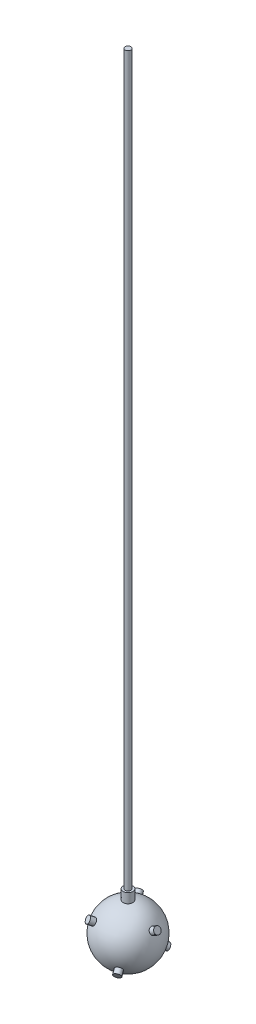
from build123d import *

# Parameters (mm, degrees)
CROQUIS2_W              = 10
CROQUIS2_H              = 20
CROQUIS164_R            = 6
SALIENTE_EXTRUIR1_DEPTH = 1500
BARRER1_PROFILE_R       = 7
MATRIZC2_COUNT          = 3


with BuildPart() as part:
    # Croquis1 → Revoluci_n1 (revolve)
    with BuildSketch(Plane.XY):
        with BuildLine():
            Line((0, -60), (0, 60))
            ThreePointArc((0, 60), (60, 0), (0, -60))
        make_face()
    revolve(axis=Axis((0, -60, 0), (0, 1, 0)))

    # Croquis2 → Revoluci_n2 (revolve)
    with BuildSketch(Plane.XY, mode=Mode.PRIVATE) as revoluci_n2_sk:
        with Locations((5, 69.160797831)):
            Rectangle(CROQUIS2_W, CROQUIS2_H)
    revolve(revoluci_n2_sk.sketch.rotate(Axis((0, 0, 0), (0, 1, 0)), 180), axis=Axis((0, 0, 0), (0, 1, 0)))

    # Croquis164 → Saliente-Extruir1 (add)
    with BuildSketch(Plane(origin=(0, 79.160797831, 0), x_dir=(1, 0, 0), z_dir=(0, 1, 0))):
        with Locations(Location((0, 0, 0), (0, 0, 270))):
            Circle(CROQUIS164_R)
    extrude(amount=SALIENTE_EXTRUIR1_DEPTH)


with BuildPart() as body_2:
    # Barrer1: sweep along a path in Croquis152
    with BuildLine(Plane.XY) as barrer1_path:
        Line((60.621778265, 35), (0, 0))
        Line((0, 0), (-60.621778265, -35))
    # Barrer1 profile (on start of the path) → Barrer1 (sweep)
    with BuildSketch(Plane(origin=(60.621778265, 35, 0), x_dir=(0.49999999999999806, -0.8660254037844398, 0), z_dir=(-0.8660254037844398, -0.49999999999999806, 0))):
        Circle(BARRER1_PROFILE_R)
    sweep(path=barrer1_path.line)


with BuildPart() as matrizc2_1:
    # MatrizC2: pattern copy
    add(body_2.part.rotate(Axis((0, 0, 0), (0, 1, 0)), 1 * 360 / MATRIZC2_COUNT))


with BuildPart() as matrizc2_2:
    # MatrizC2: pattern copy
    add(body_2.part.rotate(Axis((0, 0, 0), (0, 1, 0)), 2 * 360 / MATRIZC2_COUNT))


solid = Compound([part.part, body_2.part, matrizc2_1.part, matrizc2_2.part])
